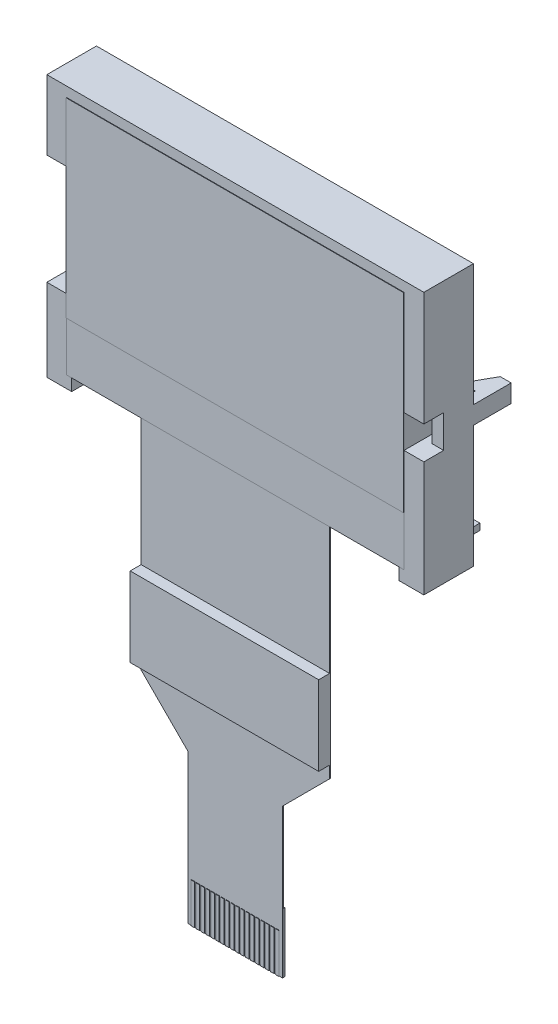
from build123d import *

# Parameters (mm, degrees)
GLASS_W                = 34
GLASS_H                = 24.22
BOSS_EXTRUDE1_DEPTH    = 3.25
BOSS_EXTRUDE2_START    = 3.25
BOSS_EXTRUDE2_DEPTH    = 5
BOSS_EXTRUDE3_START    = -1.75
PROTRUBERANCES_W       = 1.4
PROTRUBERANCES_H       = 0.65
BOSS_EXTRUDE3_DEPTH    = 4
BOSS_EXTRUDE3_2_DEPTH  = 4
PROTRUBERANCES_3_W     = 1.1
PROTRUBERANCES_3_H     = 1.8
BOSS_EXTRUDE4_DEPTH    = 3.8
SKETCH5_W              = 0.8
SKETCH5_H              = 3.3
CUT_EXTRUDE1_DEPTH     = 5
SKETCH5_3_W            = 1.2
SKETCH5_3_H            = 3.3
CUT_EXTRUDE2_DEPTH     = 2
BOSS_EXTRUDE5_DEPTH    = 1.8
BOSS_EXTRUDE6_DEPTH    = 0.1
SKETCH9_W              = 0.35
SKETCH9_H              = 4
BOSS_EXTRUDE7_DEPTH    = 0.05
BOSS_EXTRUDE7_2_DEPTH  = 0.05
BOSS_EXTRUDE7_3_DEPTH  = 0.05
BOSS_EXTRUDE7_4_DEPTH  = 0.05
BOSS_EXTRUDE7_5_DEPTH  = 0.05
BOSS_EXTRUDE7_6_DEPTH  = 0.05
BOSS_EXTRUDE7_7_DEPTH  = 0.05
BOSS_EXTRUDE7_8_DEPTH  = 0.05
BOSS_EXTRUDE7_9_DEPTH  = 0.05
BOSS_EXTRUDE7_10_DEPTH = 0.05
BOSS_EXTRUDE7_11_DEPTH = 0.05
BOSS_EXTRUDE7_12_DEPTH = 0.05
BOSS_EXTRUDE7_13_DEPTH = 0.05
BOSS_EXTRUDE7_14_DEPTH = 0.05
BOSS_EXTRUDE7_15_DEPTH = 0.05
BOSS_EXTRUDE7_16_DEPTH = 0.05
BOSS_EXTRUDE7_17_DEPTH = 0.05
BOSS_EXTRUDE7_18_DEPTH = 0.05
STIFFENER_W            = 9.5
STIFFENER_H            = 6
BOSS_EXTRUDE8_DEPTH    = 0.15
COMPONENTS_W           = 19
COMPONENTS_H           = 8
BOSS_EXTRUDE9_DEPTH    = 1.1
SKETCH12_W             = 34
SKETCH12_H             = 19.22
BOSS_EXTRUDE10_DEPTH   = 0.05


with BuildPart() as part:
    # Glass → Boss-Extrude1 (new body)
    with BuildSketch(Plane.XY):
        with Locations((0, -2.5)):
            Rectangle(GLASS_W, GLASS_H)
    extrude(amount=BOSS_EXTRUDE1_DEPTH)


with BuildPart() as body_2:
    # frame → Boss-Extrude2 (new body)
    with BuildSketch(Plane.XY.offset(BOSS_EXTRUDE2_START)):
        Polygon((-19, 10.61), (-16.982055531, 10.61), (17, 10.61), (19, 10.61), (19, -15.81), (17, -15.81), (16.5, -15.81), (16.5, -14.61), (17, -14.61), (17, 9.61), (-17, 9.61), (-17, -14.61), (-16.5, -14.61), (-16.5, -15.81), (-17, -15.81), (-19, -15.81), align=None)
    extrude(amount=-BOSS_EXTRUDE2_DEPTH)

    # protruberances_3 → Boss-Extrude4 (add)
    with BuildSketch(Plane(origin=(0, 0, -1.75), x_dir=(-1, 0, 0), z_dir=(0, 0, -1))):
        with Locations((-18.45, -2.6)):
            Rectangle(PROTRUBERANCES_3_W, PROTRUBERANCES_3_H)
        with Locations((18.45, -2.6)):
            Rectangle(PROTRUBERANCES_3_W, PROTRUBERANCES_3_H)
    extrude(amount=BOSS_EXTRUDE4_DEPTH)

    # Sketch5 → Cut-Extrude1 (cut)
    with BuildSketch(Plane.XY.offset(3.25)):
        with Locations((-17.4, -2.54)):
            Rectangle(SKETCH5_W, SKETCH5_H)
        with Locations((17.4, -2.54)):
            Rectangle(SKETCH5_W, SKETCH5_H)
    extrude(amount=-CUT_EXTRUDE1_DEPTH, mode=Mode.SUBTRACT)

    # Sketch5_3 → Cut-Extrude2 (cut)
    with BuildSketch(Plane.XY.offset(3.25)):
        Polygon((-17, 3.59), (-19, 3.59), (-19, -7.51), (-17, -7.51), (-17, -4.19), (-17.8, -4.19), (-17.8, -0.89), (-17, -0.89), align=None)
        with Locations((18.4, -2.54)):
            Rectangle(SKETCH5_3_W, SKETCH5_3_H)
    extrude(amount=-CUT_EXTRUDE2_DEPTH, mode=Mode.SUBTRACT)

    # protrub latches → Boss-Extrude5 (add)
    with BuildSketch(Plane.XZ.offset(3.5)):
        Polygon((17.9, -5.55), (17.9, -3.05), (16.5, -3.05), align=None)
        Polygon((-17.9, -5.55), (-16.5, -3.05), (-17.9, -3.05), align=None)
    extrude(amount=-BOSS_EXTRUDE5_DEPTH)


with BuildPart() as body_3:
    # protruberances → Boss-Extrude3 (new body)
    with BuildSketch(Plane(origin=(0, 0, -1.75), x_dir=(-1, 0, 0), z_dir=(0, 0, -1)).offset(BOSS_EXTRUDE3_START)):
        with Locations((-16.7, -14.285)):
            Rectangle(PROTRUBERANCES_W, PROTRUBERANCES_H)
    extrude(amount=BOSS_EXTRUDE3_DEPTH)


with BuildPart() as body_4:
    # protruberances → Boss-Extrude3 2 (new body)
    with BuildSketch(Plane(origin=(0, 0, -1.75), x_dir=(-1, 0, 0), z_dir=(0, 0, -1)).offset(BOSS_EXTRUDE3_START)):
        with Locations((16.7, -14.285)):
            Rectangle(PROTRUBERANCES_W, PROTRUBERANCES_H)
    extrude(amount=BOSS_EXTRUDE3_2_DEPTH)


with BuildPart() as body_5:
    # Tail → Boss-Extrude6 (new body)
    with BuildSketch(Plane.XY.offset(3.25)):
        Polygon((-9.5, -14.61), (9.5, -14.61), (9.5, -36.61), (4.75, -41.37), (4.75, -56.37), (-4.75, -56.37), (-4.75, -41.37), (-9.5, -36.61), align=None)
    extrude(amount=-BOSS_EXTRUDE6_DEPTH)

    # Components → Boss-Extrude9 (add)
    with BuildSketch(Plane.XY.offset(3.25)):
        with Locations((0, -31.41)):
            Rectangle(COMPONENTS_W, COMPONENTS_H)
    extrude(amount=BOSS_EXTRUDE9_DEPTH)


with BuildPart() as body_6:
    # Sketch9 → Boss-Extrude7 (new body)
    with BuildSketch(Plane.XY.offset(3.25)):
        with Locations((-4.25, -54.37)):
            Rectangle(SKETCH9_W, SKETCH9_H)
    extrude(amount=BOSS_EXTRUDE7_DEPTH)


with BuildPart() as body_7:
    # Sketch9 → Boss-Extrude7 2 (new body)
    with BuildSketch(Plane.XY.offset(3.25)):
        with Locations((-3.75, -54.37)):
            Rectangle(SKETCH9_W, SKETCH9_H)
    extrude(amount=BOSS_EXTRUDE7_2_DEPTH)


with BuildPart() as body_8:
    # Sketch9 → Boss-Extrude7 3 (new body)
    with BuildSketch(Plane.XY.offset(3.25)):
        with Locations((-3.25, -54.37)):
            Rectangle(SKETCH9_W, SKETCH9_H)
    extrude(amount=BOSS_EXTRUDE7_3_DEPTH)


with BuildPart() as body_9:
    # Sketch9 → Boss-Extrude7 4 (new body)
    with BuildSketch(Plane.XY.offset(3.25)):
        with Locations((-2.75, -54.37)):
            Rectangle(SKETCH9_W, SKETCH9_H)
    extrude(amount=BOSS_EXTRUDE7_4_DEPTH)


with BuildPart() as body_10:
    # Sketch9 → Boss-Extrude7 5 (new body)
    with BuildSketch(Plane.XY.offset(3.25)):
        with Locations((-2.25, -54.37)):
            Rectangle(SKETCH9_W, SKETCH9_H)
    extrude(amount=BOSS_EXTRUDE7_5_DEPTH)


with BuildPart() as body_11:
    # Sketch9 → Boss-Extrude7 6 (new body)
    with BuildSketch(Plane.XY.offset(3.25)):
        with Locations((-1.75, -54.37)):
            Rectangle(SKETCH9_W, SKETCH9_H)
    extrude(amount=BOSS_EXTRUDE7_6_DEPTH)


with BuildPart() as body_12:
    # Sketch9 → Boss-Extrude7 7 (new body)
    with BuildSketch(Plane.XY.offset(3.25)):
        with Locations((-1.25, -54.37)):
            Rectangle(SKETCH9_W, SKETCH9_H)
    extrude(amount=BOSS_EXTRUDE7_7_DEPTH)


with BuildPart() as body_13:
    # Sketch9 → Boss-Extrude7 8 (new body)
    with BuildSketch(Plane.XY.offset(3.25)):
        with Locations((-0.75, -54.37)):
            Rectangle(SKETCH9_W, SKETCH9_H)
    extrude(amount=BOSS_EXTRUDE7_8_DEPTH)


with BuildPart() as body_14:
    # Sketch9 → Boss-Extrude7 9 (new body)
    with BuildSketch(Plane.XY.offset(3.25)):
        with Locations((-0.25, -54.37)):
            Rectangle(SKETCH9_W, SKETCH9_H)
    extrude(amount=BOSS_EXTRUDE7_9_DEPTH)


with BuildPart() as body_15:
    # Sketch9 → Boss-Extrude7 10 (new body)
    with BuildSketch(Plane.XY.offset(3.25)):
        with Locations((0.25, -54.37)):
            Rectangle(SKETCH9_W, SKETCH9_H)
    extrude(amount=BOSS_EXTRUDE7_10_DEPTH)


with BuildPart() as body_16:
    # Sketch9 → Boss-Extrude7 11 (new body)
    with BuildSketch(Plane.XY.offset(3.25)):
        with Locations((0.75, -54.37)):
            Rectangle(SKETCH9_W, SKETCH9_H)
    extrude(amount=BOSS_EXTRUDE7_11_DEPTH)


with BuildPart() as body_17:
    # Sketch9 → Boss-Extrude7 12 (new body)
    with BuildSketch(Plane.XY.offset(3.25)):
        with Locations((1.25, -54.37)):
            Rectangle(SKETCH9_W, SKETCH9_H)
    extrude(amount=BOSS_EXTRUDE7_12_DEPTH)


with BuildPart() as body_18:
    # Sketch9 → Boss-Extrude7 13 (new body)
    with BuildSketch(Plane.XY.offset(3.25)):
        with Locations((1.75, -54.37)):
            Rectangle(SKETCH9_W, SKETCH9_H)
    extrude(amount=BOSS_EXTRUDE7_13_DEPTH)


with BuildPart() as body_19:
    # Sketch9 → Boss-Extrude7 14 (new body)
    with BuildSketch(Plane.XY.offset(3.25)):
        with Locations((2.25, -54.37)):
            Rectangle(SKETCH9_W, SKETCH9_H)
    extrude(amount=BOSS_EXTRUDE7_14_DEPTH)


with BuildPart() as body_20:
    # Sketch9 → Boss-Extrude7 15 (new body)
    with BuildSketch(Plane.XY.offset(3.25)):
        with Locations((2.75, -54.37)):
            Rectangle(SKETCH9_W, SKETCH9_H)
    extrude(amount=BOSS_EXTRUDE7_15_DEPTH)


with BuildPart() as body_21:
    # Sketch9 → Boss-Extrude7 16 (new body)
    with BuildSketch(Plane.XY.offset(3.25)):
        with Locations((3.25, -54.37)):
            Rectangle(SKETCH9_W, SKETCH9_H)
    extrude(amount=BOSS_EXTRUDE7_16_DEPTH)


with BuildPart() as body_22:
    # Sketch9 → Boss-Extrude7 17 (new body)
    with BuildSketch(Plane.XY.offset(3.25)):
        with Locations((3.75, -54.37)):
            Rectangle(SKETCH9_W, SKETCH9_H)
    extrude(amount=BOSS_EXTRUDE7_17_DEPTH)


with BuildPart() as body_23:
    # Sketch9 → Boss-Extrude7 18 (new body)
    with BuildSketch(Plane.XY.offset(3.25)):
        with Locations((4.25, -54.37)):
            Rectangle(SKETCH9_W, SKETCH9_H)
    extrude(amount=BOSS_EXTRUDE7_18_DEPTH)


with BuildPart() as body_24:
    # stiffener → Boss-Extrude8 (new body)
    with BuildSketch(Plane(origin=(0, 0, 3.15), x_dir=(-1, 0, 0), z_dir=(0, 0, -1))):
        with Locations((0, -53.37)):
            Rectangle(STIFFENER_W, STIFFENER_H)
    extrude(amount=BOSS_EXTRUDE8_DEPTH)


with BuildPart() as body_25:
    # Sketch12 → Boss-Extrude10 (new body)
    with BuildSketch(Plane.XY.offset(3.25)):
        Rectangle(SKETCH12_W, SKETCH12_H)
    extrude(amount=BOSS_EXTRUDE10_DEPTH)


solid = Compound([part.part, body_2.part, body_3.part, body_4.part, body_5.part, body_6.part, body_7.part, body_8.part, body_9.part, body_10.part, body_11.part, body_12.part, body_13.part, body_14.part, body_15.part, body_16.part, body_17.part, body_18.part, body_19.part, body_20.part, body_21.part, body_22.part, body_23.part, body_24.part, body_25.part])
